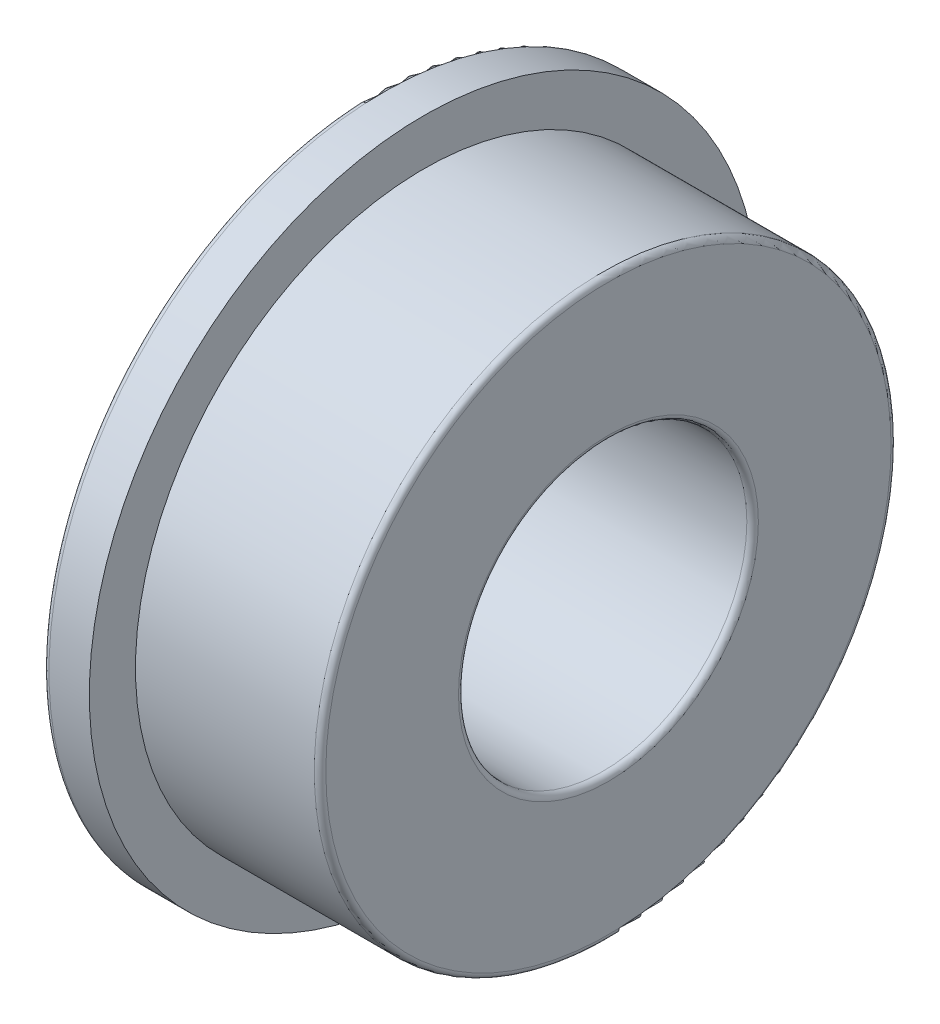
from build123d import *

# Parameters (mm, degrees)
SKETCH_1_R      = 5.8
SKETCH_1_R_2    = 2.5
EXTRUDE_1_DEPTH = 0.8
SKETCH_2_R      = 5
SKETCH_2_R_2    = 2.5
EXTRUDE_2_DEPTH = 3.2
FILLET_1_R      = 0.1


with BuildPart() as part:
    # Sketch 1 → Extrude 1 (new body)
    with BuildSketch(Plane(origin=(0, 0, 0), x_dir=(0, 0, -1), z_dir=(1, 0, 0))):
        Circle(SKETCH_1_R)
        Circle(SKETCH_1_R_2, mode=Mode.SUBTRACT)
    extrude(amount=EXTRUDE_1_DEPTH)

    # Sketch 2 → Extrude 2 (add)
    with BuildSketch(Plane(origin=(0.8, 0, 0), x_dir=(0, 0, -1), z_dir=(1, 0, 0))):
        Circle(SKETCH_2_R)
        Circle(SKETCH_2_R_2, mode=Mode.SUBTRACT)
    extrude(amount=EXTRUDE_2_DEPTH)

    # Fillet 1
    fillet_1_edges = [part.edges().sort_by_distance(p)[0] for p in [
        (4, 0, 5),
        (4, 0, 2.5),
        (0, 0, 5.8),
        (0, 0, 2.5),
    ]]
    fillet(fillet_1_edges, radius=FILLET_1_R)


solid = part.part
